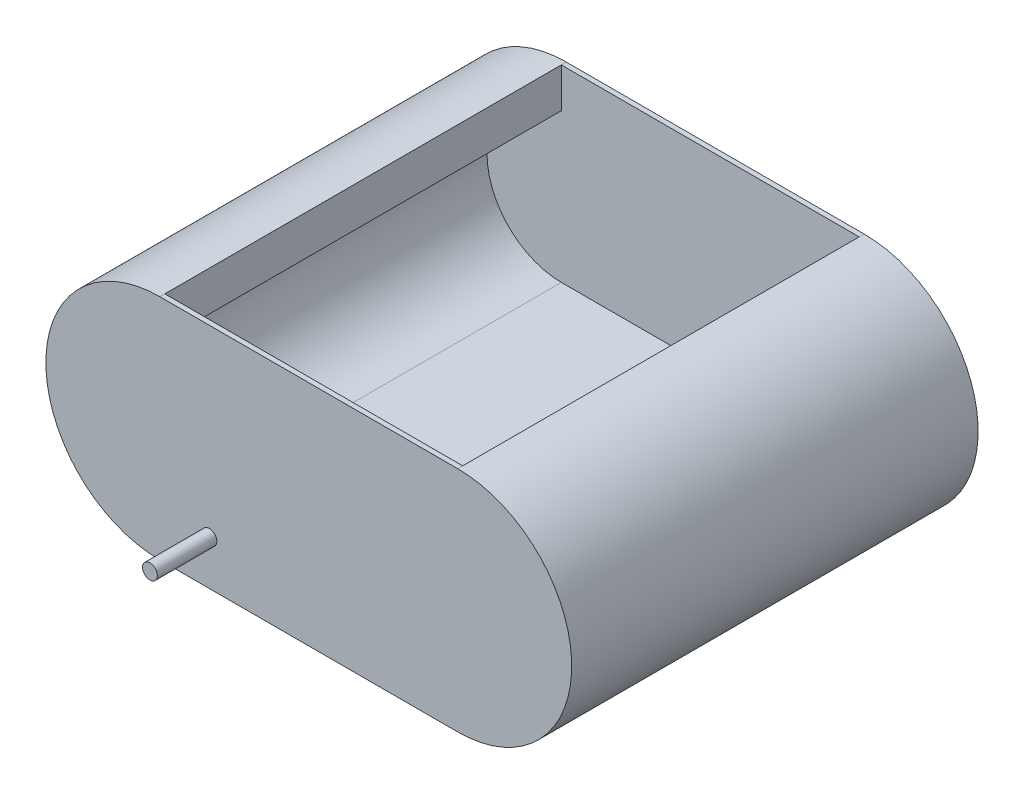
ISO-10303-21;
HEADER;
FILE_DESCRIPTION(('STEP AP214'),'2;1');
FILE_NAME('part.step','',(''),(''),'','','');
FILE_SCHEMA(('AUTOMOTIVE_DESIGN { 1 0 10303 214 1 1 1 1 }'));
ENDSEC;
DATA;
#1=APPLICATION_CONTEXT('core data for automotive mechanical design processes');
#2=APPLICATION_PROTOCOL_DEFINITION('international standard','automotive_design',2000,#1);
#3=PRODUCT_CONTEXT('',#1,'mechanical');
#4=PRODUCT('Part','Part','',(#3));
#5=PRODUCT_RELATED_PRODUCT_CATEGORY('part','',(#4));
#6=PRODUCT_DEFINITION_FORMATION('','',#4);
#7=PRODUCT_DEFINITION_CONTEXT('part definition',#1,'design');
#8=PRODUCT_DEFINITION('design','',#6,#7);
#9=PRODUCT_DEFINITION_SHAPE('','',#8);
#10=(LENGTH_UNIT() NAMED_UNIT(*) SI_UNIT(.MILLI.,.METRE.));
#11=(NAMED_UNIT(*) PLANE_ANGLE_UNIT() SI_UNIT($,.RADIAN.));
#12=(NAMED_UNIT(*) SI_UNIT($,.STERADIAN.) SOLID_ANGLE_UNIT());
#13=UNCERTAINTY_MEASURE_WITH_UNIT(LENGTH_MEASURE(1.E-05),#10,'distance_accuracy_value','');
#14=(GEOMETRIC_REPRESENTATION_CONTEXT(3) GLOBAL_UNCERTAINTY_ASSIGNED_CONTEXT((#13)) GLOBAL_UNIT_ASSIGNED_CONTEXT((#10,
#11,#12)) REPRESENTATION_CONTEXT('',''));
#15=CARTESIAN_POINT('',(0.,0.,0.));
#16=DIRECTION('',(0.,0.,1.));
#17=DIRECTION('',(1.,0.,0.));
#18=AXIS2_PLACEMENT_3D('',#15,#16,#17);
#19=CARTESIAN_POINT('',(0.,0.,800.));
#20=DIRECTION('',(0.,0.,-1.));
#21=DIRECTION('',(-1.,0.,0.));
#22=AXIS2_PLACEMENT_3D('',#19,#20,#21);
#23=CYLINDRICAL_SURFACE('',#22,230.);
#24=DIRECTION('',(0.,0.,-1.));
#25=VECTOR('',#24,1.);
#26=CARTESIAN_POINT('',(0.,230.,800.));
#27=LINE('',#26,#25);
#28=CARTESIAN_POINT('',(0.,230.,800.));
#29=VERTEX_POINT('',#28);
#30=CARTESIAN_POINT('',(0.,230.,0.));
#31=VERTEX_POINT('',#30);
#32=EDGE_CURVE('E209',#29,#31,#27,.T.);
#33=ORIENTED_EDGE('',*,*,#32,.T.);
#34=DIRECTION('',(0.,0.,1.));
#35=VECTOR('',#34,1.);
#36=CARTESIAN_POINT('',(0.,230.,-10.));
#37=LINE('',#36,#35);
#38=CARTESIAN_POINT('',(0.,230.,-10.));
#39=VERTEX_POINT('',#38);
#40=EDGE_CURVE('E129',#39,#31,#37,.T.);
#41=ORIENTED_EDGE('',*,*,#40,.F.);
#42=CARTESIAN_POINT('',(0.,0.,-10.));
#43=DIRECTION('',(0.,0.,-1.));
#44=DIRECTION('',(-1.,0.,0.));
#45=AXIS2_PLACEMENT_3D('',#42,#43,#44);
#46=CIRCLE('',#45,230.);
#47=CARTESIAN_POINT('',(0.,-230.,-10.));
#48=VERTEX_POINT('',#47);
#49=EDGE_CURVE('E143',#48,#39,#46,.T.);
#50=ORIENTED_EDGE('',*,*,#49,.F.);
#51=DIRECTION('',(0.,0.,-1.));
#52=VECTOR('',#51,1.);
#53=CARTESIAN_POINT('',(0.,-230.,800.));
#54=LINE('',#53,#52);
#55=CARTESIAN_POINT('',(0.,-230.,810.));
#56=VERTEX_POINT('',#55);
#57=EDGE_CURVE('E11',#56,#48,#54,.T.);
#58=ORIENTED_EDGE('',*,*,#57,.F.);
#59=CARTESIAN_POINT('',(0.,0.,810.));
#60=DIRECTION('',(0.,0.,1.));
#61=DIRECTION('',(1.,0.,0.));
#62=AXIS2_PLACEMENT_3D('',#59,#60,#61);
#63=CIRCLE('',#62,230.);
#64=CARTESIAN_POINT('',(0.,230.,810.));
#65=VERTEX_POINT('',#64);
#66=EDGE_CURVE('E165',#65,#56,#63,.T.);
#67=ORIENTED_EDGE('',*,*,#66,.F.);
#68=DIRECTION('',(0.,0.,-1.));
#69=VECTOR('',#68,1.);
#70=CARTESIAN_POINT('',(0.,230.,810.));
#71=LINE('',#70,#69);
#72=EDGE_CURVE('E183',#65,#29,#71,.T.);
#73=ORIENTED_EDGE('',*,*,#72,.T.);
#74=EDGE_LOOP('',(#33,#41,#50,#58,#67,#73));
#75=FACE_BOUND('',#74,.T.);
#76=ADVANCED_FACE('F44',(#75),#23,.T.);
#77=CARTESIAN_POINT('',(0.,-230.,800.));
#78=DIRECTION('',(0.,1.,0.));
#79=DIRECTION('',(0.,0.,1.));
#80=AXIS2_PLACEMENT_3D('',#77,#78,#79);
#81=PLANE('',#80);
#82=ORIENTED_EDGE('',*,*,#57,.T.);
#83=DIRECTION('',(-1.,0.,0.));
#84=VECTOR('',#83,1.);
#85=CARTESIAN_POINT('',(0.,-230.,-10.));
#86=LINE('',#85,#84);
#87=CARTESIAN_POINT('',(600.904889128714,-230.,-10.));
#88=VERTEX_POINT('',#87);
#89=EDGE_CURVE('E139',#88,#48,#86,.T.);
#90=ORIENTED_EDGE('',*,*,#89,.F.);
#91=DIRECTION('',(0.,0.,-1.));
#92=VECTOR('',#91,1.);
#93=CARTESIAN_POINT('',(600.904889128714,-230.,800.));
#94=LINE('',#93,#92);
#95=CARTESIAN_POINT('',(600.904889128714,-230.,810.));
#96=VERTEX_POINT('',#95);
#97=EDGE_CURVE('E53',#96,#88,#94,.T.);
#98=ORIENTED_EDGE('',*,*,#97,.F.);
#99=DIRECTION('',(1.,0.,0.));
#100=VECTOR('',#99,1.);
#101=CARTESIAN_POINT('',(0.,-230.,810.));
#102=LINE('',#101,#100);
#103=EDGE_CURVE('E169',#56,#96,#102,.T.);
#104=ORIENTED_EDGE('',*,*,#103,.F.);
#105=EDGE_LOOP('',(#82,#90,#98,#104));
#106=FACE_BOUND('',#105,.T.);
#107=ADVANCED_FACE('F290',(#106),#81,.F.);
#108=CARTESIAN_POINT('',(600.904889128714,0.,800.));
#109=DIRECTION('',(0.,0.,-1.));
#110=DIRECTION('',(-1.,0.,0.));
#111=AXIS2_PLACEMENT_3D('',#108,#109,#110);
#112=CYLINDRICAL_SURFACE('',#111,230.);
#113=ORIENTED_EDGE('',*,*,#97,.T.);
#114=CARTESIAN_POINT('',(600.904889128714,0.,-10.));
#115=DIRECTION('',(0.,0.,-1.));
#116=DIRECTION('',(-1.,0.,0.));
#117=AXIS2_PLACEMENT_3D('',#114,#115,#116);
#118=CIRCLE('',#117,230.);
#119=CARTESIAN_POINT('',(600.904889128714,230.,-10.));
#120=VERTEX_POINT('',#119);
#121=EDGE_CURVE('E132',#120,#88,#118,.T.);
#122=ORIENTED_EDGE('',*,*,#121,.F.);
#123=DIRECTION('',(0.,0.,1.));
#124=VECTOR('',#123,1.);
#125=CARTESIAN_POINT('',(600.904889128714,230.,-10.));
#126=LINE('',#125,#124);
#127=CARTESIAN_POINT('',(600.904889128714,230.,0.));
#128=VERTEX_POINT('',#127);
#129=EDGE_CURVE('E118',#120,#128,#126,.T.);
#130=ORIENTED_EDGE('',*,*,#129,.T.);
#131=DIRECTION('',(0.,0.,-1.));
#132=VECTOR('',#131,1.);
#133=CARTESIAN_POINT('',(600.904889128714,230.,800.));
#134=LINE('',#133,#132);
#135=CARTESIAN_POINT('',(600.904889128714,230.,800.));
#136=VERTEX_POINT('',#135);
#137=EDGE_CURVE('E244',#136,#128,#134,.T.);
#138=ORIENTED_EDGE('',*,*,#137,.F.);
#139=DIRECTION('',(0.,0.,-1.));
#140=VECTOR('',#139,1.);
#141=CARTESIAN_POINT('',(600.904889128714,230.,810.));
#142=LINE('',#141,#140);
#143=CARTESIAN_POINT('',(600.904889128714,230.,810.));
#144=VERTEX_POINT('',#143);
#145=EDGE_CURVE('E176',#144,#136,#142,.T.);
#146=ORIENTED_EDGE('',*,*,#145,.F.);
#147=CARTESIAN_POINT('',(600.904889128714,0.,810.));
#148=DIRECTION('',(0.,0.,1.));
#149=DIRECTION('',(1.,0.,0.));
#150=AXIS2_PLACEMENT_3D('',#147,#148,#149);
#151=CIRCLE('',#150,230.);
#152=EDGE_CURVE('E173',#96,#144,#151,.T.);
#153=ORIENTED_EDGE('',*,*,#152,.F.);
#154=EDGE_LOOP('',(#113,#122,#130,#138,#146,#153));
#155=FACE_BOUND('',#154,.T.);
#156=ADVANCED_FACE('F133',(#155),#112,.T.);
#157=CARTESIAN_POINT('',(600.904889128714,150.,800.));
#158=DIRECTION('',(1.,0.,0.));
#159=DIRECTION('',(0.,0.,-1.));
#160=AXIS2_PLACEMENT_3D('',#157,#158,#159);
#161=PLANE('',#160);
#162=DIRECTION('',(0.,-1.,0.));
#163=VECTOR('',#162,1.);
#164=CARTESIAN_POINT('',(600.904889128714,150.,0.));
#165=LINE('',#164,#163);
#166=CARTESIAN_POINT('',(600.904889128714,150.,0.));
#167=VERTEX_POINT('',#166);
#168=EDGE_CURVE('E187',#128,#167,#165,.T.);
#169=ORIENTED_EDGE('',*,*,#168,.T.);
#170=DIRECTION('',(0.,0.,-1.));
#171=VECTOR('',#170,1.);
#172=CARTESIAN_POINT('',(600.904889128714,150.,800.));
#173=LINE('',#172,#171);
#174=CARTESIAN_POINT('',(600.904889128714,150.,800.));
#175=VERTEX_POINT('',#174);
#176=EDGE_CURVE('E240',#175,#167,#173,.T.);
#177=ORIENTED_EDGE('',*,*,#176,.F.);
#178=DIRECTION('',(0.,-1.,0.));
#179=VECTOR('',#178,1.);
#180=CARTESIAN_POINT('',(600.904889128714,150.,800.));
#181=LINE('',#180,#179);
#182=EDGE_CURVE('E188',#136,#175,#181,.T.);
#183=ORIENTED_EDGE('',*,*,#182,.F.);
#184=ORIENTED_EDGE('',*,*,#137,.T.);
#185=EDGE_LOOP('',(#169,#177,#183,#184));
#186=FACE_BOUND('',#185,.T.);
#187=ADVANCED_FACE('F279',(#186),#161,.F.);
#188=CARTESIAN_POINT('',(600.904889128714,0.,800.));
#189=DIRECTION('',(0.,0.,-1.));
#190=DIRECTION('',(-1.,0.,0.));
#191=AXIS2_PLACEMENT_3D('',#188,#189,#190);
#192=CYLINDRICAL_SURFACE('',#191,150.);
#193=CARTESIAN_POINT('',(600.904889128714,0.,0.));
#194=DIRECTION('',(0.,0.,-1.));
#195=DIRECTION('',(1.,0.,0.));
#196=AXIS2_PLACEMENT_3D('',#193,#194,#195);
#197=CIRCLE('',#196,150.);
#198=CARTESIAN_POINT('',(600.904889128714,-150.,0.));
#199=VERTEX_POINT('',#198);
#200=EDGE_CURVE('E213',#167,#199,#197,.T.);
#201=ORIENTED_EDGE('',*,*,#200,.T.);
#202=DIRECTION('',(0.,0.,-1.));
#203=VECTOR('',#202,1.);
#204=CARTESIAN_POINT('',(600.904889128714,-150.,800.));
#205=LINE('',#204,#203);
#206=CARTESIAN_POINT('',(600.904889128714,-150.,800.));
#207=VERTEX_POINT('',#206);
#208=EDGE_CURVE('E236',#207,#199,#205,.T.);
#209=ORIENTED_EDGE('',*,*,#208,.F.);
#210=CARTESIAN_POINT('',(600.904889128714,0.,800.));
#211=DIRECTION('',(0.,0.,-1.));
#212=DIRECTION('',(1.,0.,0.));
#213=AXIS2_PLACEMENT_3D('',#210,#211,#212);
#214=CIRCLE('',#213,150.);
#215=EDGE_CURVE('E192',#175,#207,#214,.T.);
#216=ORIENTED_EDGE('',*,*,#215,.F.);
#217=ORIENTED_EDGE('',*,*,#176,.T.);
#218=EDGE_LOOP('',(#201,#209,#216,#217));
#219=FACE_BOUND('',#218,.T.);
#220=ADVANCED_FACE('F304',(#219),#192,.F.);
#221=CARTESIAN_POINT('',(0.,-150.,800.));
#222=DIRECTION('',(0.,-1.,0.));
#223=DIRECTION('',(0.,0.,-1.));
#224=AXIS2_PLACEMENT_3D('',#221,#222,#223);
#225=PLANE('',#224);
#226=DIRECTION('',(-1.,0.,0.));
#227=VECTOR('',#226,1.);
#228=CARTESIAN_POINT('',(0.,-150.,0.));
#229=LINE('',#228,#227);
#230=CARTESIAN_POINT('',(0.,-150.,0.));
#231=VERTEX_POINT('',#230);
#232=EDGE_CURVE('E217',#199,#231,#229,.T.);
#233=ORIENTED_EDGE('',*,*,#232,.T.);
#234=DIRECTION('',(0.,0.,-1.));
#235=VECTOR('',#234,1.);
#236=CARTESIAN_POINT('',(0.,-150.,800.));
#237=LINE('',#236,#235);
#238=CARTESIAN_POINT('',(0.,-150.,800.));
#239=VERTEX_POINT('',#238);
#240=EDGE_CURVE('E232',#239,#231,#237,.T.);
#241=ORIENTED_EDGE('',*,*,#240,.F.);
#242=DIRECTION('',(-1.,0.,0.));
#243=VECTOR('',#242,1.);
#244=CARTESIAN_POINT('',(0.,-150.,800.));
#245=LINE('',#244,#243);
#246=EDGE_CURVE('E197',#207,#239,#245,.T.);
#247=ORIENTED_EDGE('',*,*,#246,.F.);
#248=ORIENTED_EDGE('',*,*,#208,.T.);
#249=EDGE_LOOP('',(#233,#241,#247,#248));
#250=FACE_BOUND('',#249,.T.);
#251=ADVANCED_FACE('F302',(#250),#225,.F.);
#252=CARTESIAN_POINT('',(0.,0.,800.));
#253=DIRECTION('',(0.,0.,-1.));
#254=DIRECTION('',(-1.,0.,0.));
#255=AXIS2_PLACEMENT_3D('',#252,#253,#254);
#256=CYLINDRICAL_SURFACE('',#255,150.);
#257=CARTESIAN_POINT('',(0.,0.,0.));
#258=DIRECTION('',(0.,0.,-1.));
#259=DIRECTION('',(1.,0.,0.));
#260=AXIS2_PLACEMENT_3D('',#257,#258,#259);
#261=CIRCLE('',#260,150.);
#262=CARTESIAN_POINT('',(0.,150.,0.));
#263=VERTEX_POINT('',#262);
#264=EDGE_CURVE('E221',#231,#263,#261,.T.);
#265=ORIENTED_EDGE('',*,*,#264,.T.);
#266=DIRECTION('',(0.,0.,-1.));
#267=VECTOR('',#266,1.);
#268=CARTESIAN_POINT('',(0.,150.,800.));
#269=LINE('',#268,#267);
#270=CARTESIAN_POINT('',(0.,150.,800.));
#271=VERTEX_POINT('',#270);
#272=EDGE_CURVE('E60',#271,#263,#269,.T.);
#273=ORIENTED_EDGE('',*,*,#272,.F.);
#274=CARTESIAN_POINT('',(0.,0.,800.));
#275=DIRECTION('',(0.,0.,-1.));
#276=DIRECTION('',(1.,0.,0.));
#277=AXIS2_PLACEMENT_3D('',#274,#275,#276);
#278=CIRCLE('',#277,150.);
#279=EDGE_CURVE('E201',#239,#271,#278,.T.);
#280=ORIENTED_EDGE('',*,*,#279,.F.);
#281=ORIENTED_EDGE('',*,*,#240,.T.);
#282=EDGE_LOOP('',(#265,#273,#280,#281));
#283=FACE_BOUND('',#282,.T.);
#284=ADVANCED_FACE('F300',(#283),#256,.F.);
#285=CARTESIAN_POINT('',(0.,150.,800.));
#286=DIRECTION('',(-1.,0.,0.));
#287=DIRECTION('',(0.,0.,1.));
#288=AXIS2_PLACEMENT_3D('',#285,#286,#287);
#289=PLANE('',#288);
#290=DIRECTION('',(0.,1.,0.));
#291=VECTOR('',#290,1.);
#292=CARTESIAN_POINT('',(0.,150.,0.));
#293=LINE('',#292,#291);
#294=EDGE_CURVE('E193',#263,#31,#293,.T.);
#295=ORIENTED_EDGE('',*,*,#294,.T.);
#296=ORIENTED_EDGE('',*,*,#32,.F.);
#297=DIRECTION('',(0.,1.,0.));
#298=VECTOR('',#297,1.);
#299=CARTESIAN_POINT('',(0.,150.,800.));
#300=LINE('',#299,#298);
#301=EDGE_CURVE('E205',#271,#29,#300,.T.);
#302=ORIENTED_EDGE('',*,*,#301,.F.);
#303=ORIENTED_EDGE('',*,*,#272,.T.);
#304=EDGE_LOOP('',(#295,#296,#302,#303));
#305=FACE_BOUND('',#304,.T.);
#306=ADVANCED_FACE('F296',(#305),#289,.F.);
#307=CARTESIAN_POINT('',(0.,0.,800.));
#308=DIRECTION('',(0.,0.,1.));
#309=DIRECTION('',(1.,0.,0.));
#310=AXIS2_PLACEMENT_3D('',#307,#308,#309);
#311=PLANE('',#310);
#312=DIRECTION('',(1.,0.,0.));
#313=VECTOR('',#312,1.);
#314=CARTESIAN_POINT('',(0.,230.,800.));
#315=LINE('',#314,#313);
#316=EDGE_CURVE('E128',#29,#136,#315,.T.);
#317=ORIENTED_EDGE('',*,*,#316,.T.);
#318=ORIENTED_EDGE('',*,*,#182,.T.);
#319=ORIENTED_EDGE('',*,*,#215,.T.);
#320=ORIENTED_EDGE('',*,*,#246,.T.);
#321=ORIENTED_EDGE('',*,*,#279,.T.);
#322=ORIENTED_EDGE('',*,*,#301,.T.);
#323=EDGE_LOOP('',(#317,#318,#319,#320,#321,#322));
#324=FACE_BOUND('',#323,.T.);
#325=ADVANCED_FACE('F298',(#324),#311,.F.);
#326=CARTESIAN_POINT('',(0.,230.,810.));
#327=DIRECTION('',(0.,1.,0.));
#328=DIRECTION('',(0.,0.,1.));
#329=AXIS2_PLACEMENT_3D('',#326,#327,#328);
#330=PLANE('',#329);
#331=ORIENTED_EDGE('',*,*,#316,.F.);
#332=ORIENTED_EDGE('',*,*,#72,.F.);
#333=DIRECTION('',(1.,0.,0.));
#334=VECTOR('',#333,1.);
#335=CARTESIAN_POINT('',(0.,230.,810.));
#336=LINE('',#335,#334);
#337=EDGE_CURVE('E161',#65,#144,#336,.T.);
#338=ORIENTED_EDGE('',*,*,#337,.T.);
#339=ORIENTED_EDGE('',*,*,#145,.T.);
#340=EDGE_LOOP('',(#331,#332,#338,#339));
#341=FACE_BOUND('',#340,.T.);
#342=ADVANCED_FACE('F284',(#341),#330,.T.);
#343=CARTESIAN_POINT('',(0.,0.,810.));
#344=DIRECTION('',(0.,0.,1.));
#345=DIRECTION('',(1.,0.,0.));
#346=AXIS2_PLACEMENT_3D('',#343,#344,#345);
#347=PLANE('',#346);
#348=CARTESIAN_POINT('',(100.,-140.,810.));
#349=DIRECTION('',(0.,0.,1.));
#350=DIRECTION('',(1.,0.,0.));
#351=AXIS2_PLACEMENT_3D('',#348,#349,#350);
#352=CIRCLE('',#351,15.);
#353=CARTESIAN_POINT('',(115.,-140.,810.));
#354=VERTEX_POINT('',#353);
#355=EDGE_CURVE('E152',#354,#354,#352,.T.);
#356=ORIENTED_EDGE('',*,*,#355,.F.);
#357=EDGE_LOOP('',(#356));
#358=FACE_BOUND('',#357,.T.);
#359=ORIENTED_EDGE('',*,*,#337,.F.);
#360=ORIENTED_EDGE('',*,*,#66,.T.);
#361=ORIENTED_EDGE('',*,*,#103,.T.);
#362=ORIENTED_EDGE('',*,*,#152,.T.);
#363=EDGE_LOOP('',(#359,#360,#361,#362));
#364=FACE_BOUND('',#363,.T.);
#365=ADVANCED_FACE('F287',(#358,#364),#347,.T.);
#366=CARTESIAN_POINT('',(0.,230.,-10.));
#367=DIRECTION('',(0.,1.,0.));
#368=DIRECTION('',(0.,0.,1.));
#369=AXIS2_PLACEMENT_3D('',#366,#367,#368);
#370=PLANE('',#369);
#371=DIRECTION('',(-1.,0.,0.));
#372=VECTOR('',#371,1.);
#373=CARTESIAN_POINT('',(0.,230.,0.));
#374=LINE('',#373,#372);
#375=EDGE_CURVE('E124',#128,#31,#374,.T.);
#376=ORIENTED_EDGE('',*,*,#375,.F.);
#377=ORIENTED_EDGE('',*,*,#129,.F.);
#378=DIRECTION('',(-1.,0.,0.));
#379=VECTOR('',#378,1.);
#380=CARTESIAN_POINT('',(0.,230.,-10.));
#381=LINE('',#380,#379);
#382=EDGE_CURVE('E122',#120,#39,#381,.T.);
#383=ORIENTED_EDGE('',*,*,#382,.T.);
#384=ORIENTED_EDGE('',*,*,#40,.T.);
#385=EDGE_LOOP('',(#376,#377,#383,#384));
#386=FACE_BOUND('',#385,.T.);
#387=ADVANCED_FACE('F120',(#386),#370,.T.);
#388=CARTESIAN_POINT('',(0.,0.,-10.));
#389=DIRECTION('',(0.,0.,-1.));
#390=DIRECTION('',(-1.,0.,0.));
#391=AXIS2_PLACEMENT_3D('',#388,#389,#390);
#392=PLANE('',#391);
#393=CARTESIAN_POINT('',(100.,-140.,-10.));
#394=DIRECTION('',(0.,0.,-1.));
#395=DIRECTION('',(-1.,0.,0.));
#396=AXIS2_PLACEMENT_3D('',#393,#394,#395);
#397=CIRCLE('',#396,15.);
#398=CARTESIAN_POINT('',(85.,-140.,-10.));
#399=VERTEX_POINT('',#398);
#400=EDGE_CURVE('E546',#399,#399,#397,.T.);
#401=ORIENTED_EDGE('',*,*,#400,.F.);
#402=EDGE_LOOP('',(#401));
#403=FACE_BOUND('',#402,.T.);
#404=ORIENTED_EDGE('',*,*,#382,.F.);
#405=ORIENTED_EDGE('',*,*,#121,.T.);
#406=ORIENTED_EDGE('',*,*,#89,.T.);
#407=ORIENTED_EDGE('',*,*,#49,.T.);
#408=EDGE_LOOP('',(#404,#405,#406,#407));
#409=FACE_BOUND('',#408,.T.);
#410=ADVANCED_FACE('F141',(#403,#409),#392,.T.);
#411=CARTESIAN_POINT('',(0.,0.,0.));
#412=DIRECTION('',(0.,0.,-1.));
#413=DIRECTION('',(-1.,0.,0.));
#414=AXIS2_PLACEMENT_3D('',#411,#412,#413);
#415=PLANE('',#414);
#416=ORIENTED_EDGE('',*,*,#294,.F.);
#417=ORIENTED_EDGE('',*,*,#264,.F.);
#418=ORIENTED_EDGE('',*,*,#232,.F.);
#419=ORIENTED_EDGE('',*,*,#200,.F.);
#420=ORIENTED_EDGE('',*,*,#168,.F.);
#421=ORIENTED_EDGE('',*,*,#375,.T.);
#422=EDGE_LOOP('',(#416,#417,#418,#419,#420,#421));
#423=FACE_BOUND('',#422,.T.);
#424=ADVANCED_FACE('F293',(#423),#415,.F.);
#425=CARTESIAN_POINT('',(100.,-140.,930.));
#426=DIRECTION('',(0.,0.,-1.));
#427=DIRECTION('',(-1.,0.,0.));
#428=AXIS2_PLACEMENT_3D('',#425,#426,#427);
#429=CYLINDRICAL_SURFACE('',#428,15.);
#430=CARTESIAN_POINT('',(100.,-140.,930.));
#431=DIRECTION('',(0.,0.,1.));
#432=DIRECTION('',(1.,0.,0.));
#433=AXIS2_PLACEMENT_3D('',#430,#431,#432);
#434=CIRCLE('',#433,15.);
#435=CARTESIAN_POINT('',(115.,-140.,930.));
#436=VERTEX_POINT('',#435);
#437=EDGE_CURVE('E149',#436,#436,#434,.T.);
#438=ORIENTED_EDGE('',*,*,#437,.F.);
#439=EDGE_LOOP('',(#438));
#440=FACE_BOUND('',#439,.T.);
#441=ORIENTED_EDGE('',*,*,#355,.T.);
#442=EDGE_LOOP('',(#441));
#443=FACE_BOUND('',#442,.T.);
#444=ADVANCED_FACE('F406',(#440,#443),#429,.T.);
#445=CARTESIAN_POINT('',(100.,-140.,930.));
#446=DIRECTION('',(0.,0.,1.));
#447=DIRECTION('',(1.,0.,0.));
#448=AXIS2_PLACEMENT_3D('',#445,#446,#447);
#449=PLANE('',#448);
#450=ORIENTED_EDGE('',*,*,#437,.T.);
#451=EDGE_LOOP('',(#450));
#452=FACE_BOUND('',#451,.T.);
#453=ADVANCED_FACE('F414',(#452),#449,.T.);
#454=CARTESIAN_POINT('',(100.,-140.,-130.));
#455=DIRECTION('',(0.,0.,1.));
#456=DIRECTION('',(1.,0.,0.));
#457=AXIS2_PLACEMENT_3D('',#454,#455,#456);
#458=CYLINDRICAL_SURFACE('',#457,15.);
#459=CARTESIAN_POINT('',(100.,-140.,-130.));
#460=DIRECTION('',(0.,0.,-1.));
#461=DIRECTION('',(-1.,0.,0.));
#462=AXIS2_PLACEMENT_3D('',#459,#460,#461);
#463=CIRCLE('',#462,15.);
#464=CARTESIAN_POINT('',(85.,-140.,-130.));
#465=VERTEX_POINT('',#464);
#466=EDGE_CURVE('E544',#465,#465,#463,.T.);
#467=ORIENTED_EDGE('',*,*,#466,.F.);
#468=EDGE_LOOP('',(#467));
#469=FACE_BOUND('',#468,.T.);
#470=ORIENTED_EDGE('',*,*,#400,.T.);
#471=EDGE_LOOP('',(#470));
#472=FACE_BOUND('',#471,.T.);
#473=ADVANCED_FACE('F424',(#469,#472),#458,.T.);
#474=CARTESIAN_POINT('',(100.,-140.,-130.));
#475=DIRECTION('',(0.,0.,-1.));
#476=DIRECTION('',(-1.,0.,0.));
#477=AXIS2_PLACEMENT_3D('',#474,#475,#476);
#478=PLANE('',#477);
#479=ORIENTED_EDGE('',*,*,#466,.T.);
#480=EDGE_LOOP('',(#479));
#481=FACE_BOUND('',#480,.T.);
#482=ADVANCED_FACE('F434',(#481),#478,.T.);
#483=CLOSED_SHELL('',(#76,#107,#156,#187,#220,#251,#284,#306,#325,#342,#365,#387,#410,#424,#444,
#453,#473,#482));
#484=MANIFOLD_SOLID_BREP('B2',#483);
#485=ADVANCED_BREP_SHAPE_REPRESENTATION('',(#18,#484),#14);
#486=SHAPE_DEFINITION_REPRESENTATION(#9,#485);
ENDSEC;
END-ISO-10303-21;
